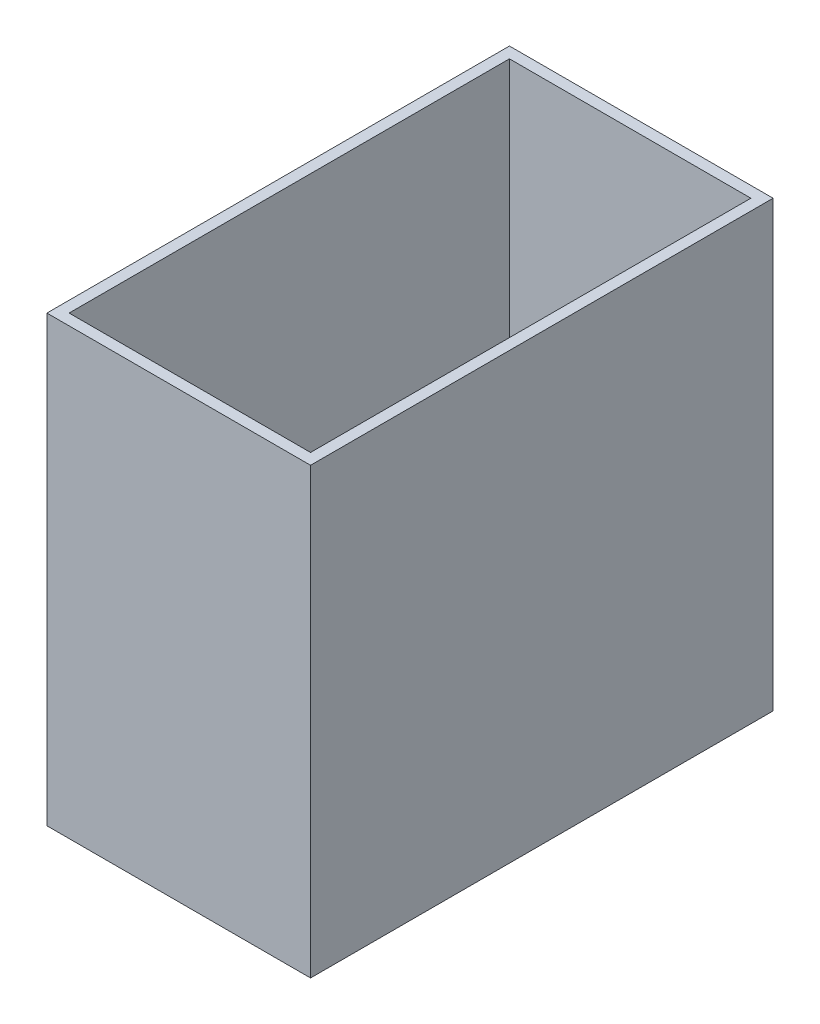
from build123d import *

# Parameters (mm, degrees)
ESBO_O1_W                = 142.5
ESBO_O1_H                = 250
RESSALTO_EXTRUS_O1_DEPTH = 240
ESBO_O2_W                = 130.5
ESBO_O2_H                = 238
CORTE_EXTRUS_O1_DEPTH    = 234


with BuildPart() as part:
    # Esbo_o1 → Ressalto-extrus_o1 (new body)
    with BuildSketch(Plane(origin=(0, 0, 0), x_dir=(1, 0, 0), z_dir=(0, 1, 0))):
        with Locations((71.25, -125)):
            Rectangle(ESBO_O1_W, ESBO_O1_H)
    extrude(amount=RESSALTO_EXTRUS_O1_DEPTH)

    # Esbo_o2 → Corte-extrus_o1 (cut)
    with BuildSketch(Plane(origin=(0, 240, 0), x_dir=(1, 0, 0), z_dir=(0, 1, 0))):
        with Locations((71.25, -125)):
            Rectangle(ESBO_O2_W, ESBO_O2_H)
    extrude(amount=-CORTE_EXTRUS_O1_DEPTH, mode=Mode.SUBTRACT)


solid = part.part
